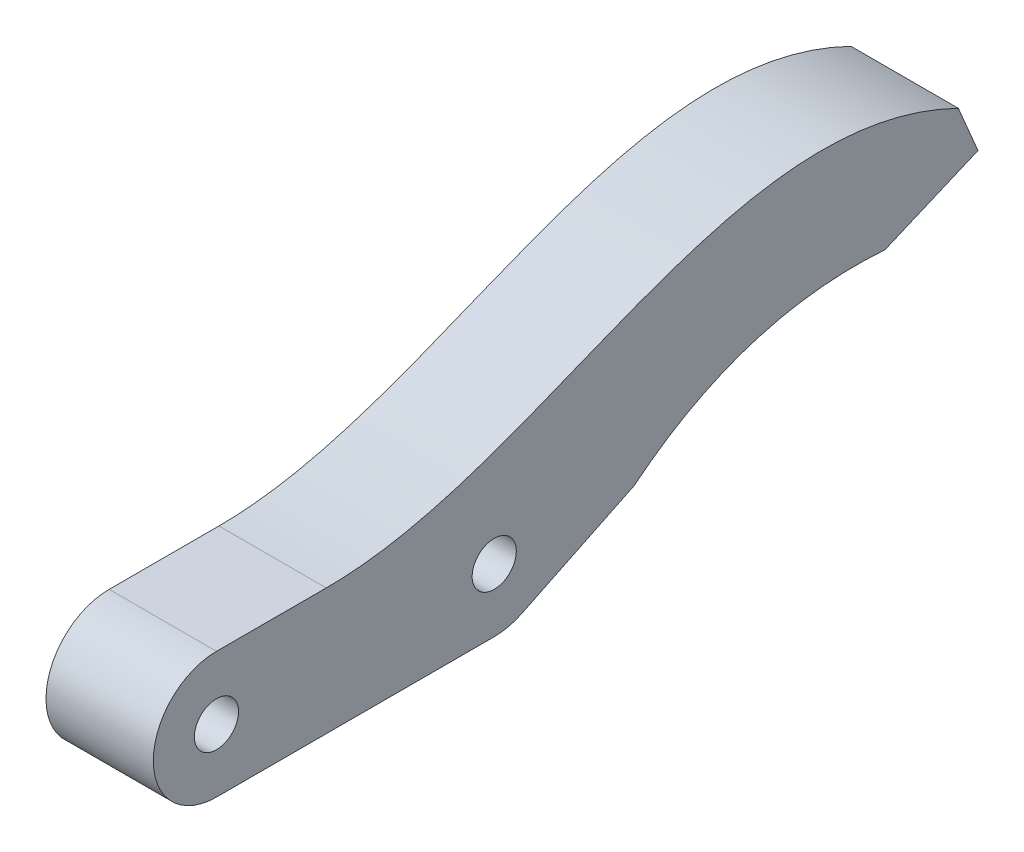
from build123d import *

# Parameters (mm, degrees)
SKETCH1_R           = 1.75
BOSS_EXTRUDE1_DEPTH = 8.5
BOSS_EXTRUDE2_START = -8.5
BOSS_EXTRUDE2_DEPTH = 8.5


with BuildPart() as part:
    # Sketch1 → Boss-Extrude1 (new body)
    with BuildSketch(Plane(origin=(0, 0, 0), x_dir=(0, 0, -1), z_dir=(1, 0, 0))):
        with BuildLine():
            Line((27, 10), (5, 10))
            ThreePointArc((5, 10), (0, 5), (5, 0))
            Line((5, 0), (27, 0))
            ThreePointArc((27, 0), (32, 5), (27, 10))
        make_face()
        with Locations((5, 5)):
            Circle(SKETCH1_R, mode=Mode.SUBTRACT)
        with Locations((27, 5)):
            Circle(SKETCH1_R, mode=Mode.SUBTRACT)
    extrude(amount=BOSS_EXTRUDE1_DEPTH)

    # Sketch2 → Boss-Extrude2 (add)
    with BuildSketch(Plane(origin=(8.5, 0, 0), x_dir=(0, 0, -1), z_dir=(1, 0, 0)).offset(BOSS_EXTRUDE2_START)):
        with BuildLine():
            add(Edge.make_bspline(
                [(63.752972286, 17.872423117), (45.928882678, 26.563787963), (31.059268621, 10), (13.694974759, 10)],
                knots=[0, 0, 0, 0, 1, 1, 1, 1], degree=3))
            Line((13.694974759, 10), (27, 10))
            ThreePointArc((27, 10), (31.87285141, 6.120410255), (29.183837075, 0.502127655))
            Line((29.183837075, 0.502127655), (38.08542066, 4.824084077))
            add(Edge.make_bspline(
                [(38.08542066, 4.824084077), (46.797509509, 11.895222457), (57.948000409, 11.067843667)],
                knots=[0, 0, 0, 1, 1, 1], degree=2))
            Line((57.948000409, 11.067843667), (65.313809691, 14.189518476))
            Line((65.313809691, 14.189518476), (63.752972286, 17.872423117))
        make_face()
    extrude(amount=BOSS_EXTRUDE2_DEPTH)


solid = part.part
